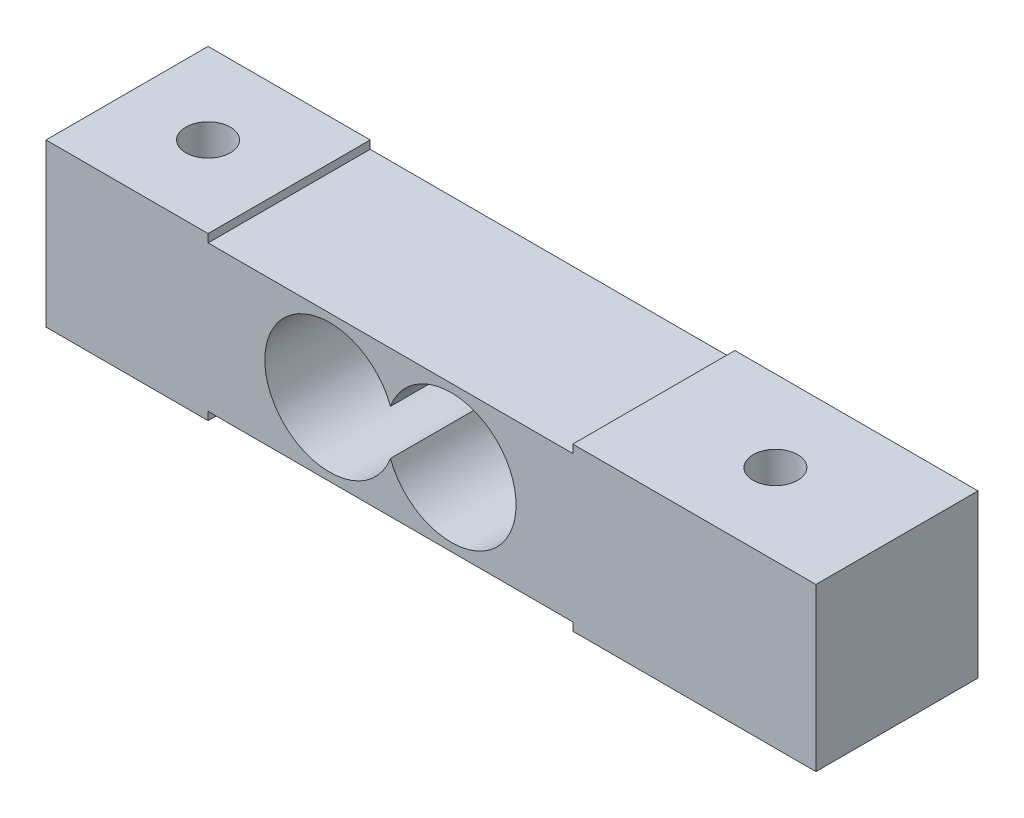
ISO-10303-21;
HEADER;
FILE_DESCRIPTION(('STEP AP214'),'2;1');
FILE_NAME('part.step','',(''),(''),'','','');
FILE_SCHEMA(('AUTOMOTIVE_DESIGN { 1 0 10303 214 1 1 1 1 }'));
ENDSEC;
DATA;
#1=APPLICATION_CONTEXT('core data for automotive mechanical design processes');
#2=APPLICATION_PROTOCOL_DEFINITION('international standard','automotive_design',2000,#1);
#3=PRODUCT_CONTEXT('',#1,'mechanical');
#4=PRODUCT('Part','Part','',(#3));
#5=PRODUCT_RELATED_PRODUCT_CATEGORY('part','',(#4));
#6=PRODUCT_DEFINITION_FORMATION('','',#4);
#7=PRODUCT_DEFINITION_CONTEXT('part definition',#1,'design');
#8=PRODUCT_DEFINITION('design','',#6,#7);
#9=PRODUCT_DEFINITION_SHAPE('','',#8);
#10=(LENGTH_UNIT() NAMED_UNIT(*) SI_UNIT(.MILLI.,.METRE.));
#11=(NAMED_UNIT(*) PLANE_ANGLE_UNIT() SI_UNIT($,.RADIAN.));
#12=(NAMED_UNIT(*) SI_UNIT($,.STERADIAN.) SOLID_ANGLE_UNIT());
#13=UNCERTAINTY_MEASURE_WITH_UNIT(LENGTH_MEASURE(1.E-05),#10,'distance_accuracy_value','');
#14=(GEOMETRIC_REPRESENTATION_CONTEXT(3) GLOBAL_UNCERTAINTY_ASSIGNED_CONTEXT((#13)) GLOBAL_UNIT_ASSIGNED_CONTEXT((#10,
#11,#12)) REPRESENTATION_CONTEXT('',''));
#15=CARTESIAN_POINT('',(0.,0.,0.));
#16=DIRECTION('',(0.,0.,1.));
#17=DIRECTION('',(1.,0.,0.));
#18=AXIS2_PLACEMENT_3D('',#15,#16,#17);
#19=CARTESIAN_POINT('',(0.,-19.,20.));
#20=DIRECTION('',(0.,0.,1.));
#21=DIRECTION('',(1.,0.,0.));
#22=AXIS2_PLACEMENT_3D('',#19,#20,#21);
#23=PLANE('',#22);
#24=DIRECTION('',(0.,-1.,0.));
#25=VECTOR('',#24,1.);
#26=CARTESIAN_POINT('',(0.,0.,20.));
#27=LINE('',#26,#25);
#28=CARTESIAN_POINT('',(0.,0.,20.));
#29=VERTEX_POINT('',#28);
#30=CARTESIAN_POINT('',(0.,-20.,20.));
#31=VERTEX_POINT('',#30);
#32=EDGE_CURVE('E179',#29,#31,#27,.T.);
#33=ORIENTED_EDGE('',*,*,#32,.T.);
#34=DIRECTION('',(1.,0.,0.));
#35=VECTOR('',#34,1.);
#36=CARTESIAN_POINT('',(0.,-20.,20.));
#37=LINE('',#36,#35);
#38=CARTESIAN_POINT('',(20.,-20.,20.));
#39=VERTEX_POINT('',#38);
#40=EDGE_CURVE('E182',#31,#39,#37,.T.);
#41=ORIENTED_EDGE('',*,*,#40,.T.);
#42=DIRECTION('',(0.,1.,0.));
#43=VECTOR('',#42,1.);
#44=CARTESIAN_POINT('',(20.,-19.,20.));
#45=LINE('',#44,#43);
#46=CARTESIAN_POINT('',(20.,-19.,20.));
#47=VERTEX_POINT('',#46);
#48=EDGE_CURVE('E184',#39,#47,#45,.T.);
#49=ORIENTED_EDGE('',*,*,#48,.T.);
#50=DIRECTION('',(1.,0.,0.));
#51=VECTOR('',#50,1.);
#52=CARTESIAN_POINT('',(20.,-19.,20.));
#53=LINE('',#52,#51);
#54=CARTESIAN_POINT('',(65.,-19.,20.));
#55=VERTEX_POINT('',#54);
#56=EDGE_CURVE('E186',#47,#55,#53,.T.);
#57=ORIENTED_EDGE('',*,*,#56,.T.);
#58=DIRECTION('',(0.,-1.,0.));
#59=VECTOR('',#58,1.);
#60=CARTESIAN_POINT('',(65.,-19.,20.));
#61=LINE('',#60,#59);
#62=CARTESIAN_POINT('',(65.,-20.,20.));
#63=VERTEX_POINT('',#62);
#64=EDGE_CURVE('E188',#55,#63,#61,.T.);
#65=ORIENTED_EDGE('',*,*,#64,.T.);
#66=DIRECTION('',(1.,0.,0.));
#67=VECTOR('',#66,1.);
#68=CARTESIAN_POINT('',(65.,-20.,20.));
#69=LINE('',#68,#67);
#70=CARTESIAN_POINT('',(95.,-20.,20.));
#71=VERTEX_POINT('',#70);
#72=EDGE_CURVE('E190',#63,#71,#69,.T.);
#73=ORIENTED_EDGE('',*,*,#72,.T.);
#74=DIRECTION('',(0.,1.,0.));
#75=VECTOR('',#74,1.);
#76=CARTESIAN_POINT('',(95.,0.,20.));
#77=LINE('',#76,#75);
#78=CARTESIAN_POINT('',(95.,0.,20.));
#79=VERTEX_POINT('',#78);
#80=EDGE_CURVE('E192',#71,#79,#77,.T.);
#81=ORIENTED_EDGE('',*,*,#80,.T.);
#82=DIRECTION('',(-1.,0.,0.));
#83=VECTOR('',#82,1.);
#84=CARTESIAN_POINT('',(65.,0.,20.));
#85=LINE('',#84,#83);
#86=CARTESIAN_POINT('',(65.,0.,20.));
#87=VERTEX_POINT('',#86);
#88=EDGE_CURVE('E194',#79,#87,#85,.T.);
#89=ORIENTED_EDGE('',*,*,#88,.T.);
#90=DIRECTION('',(0.,-1.,0.));
#91=VECTOR('',#90,1.);
#92=CARTESIAN_POINT('',(65.,0.,20.));
#93=LINE('',#92,#91);
#94=CARTESIAN_POINT('',(65.,-1.,20.));
#95=VERTEX_POINT('',#94);
#96=EDGE_CURVE('E196',#87,#95,#93,.T.);
#97=ORIENTED_EDGE('',*,*,#96,.T.);
#98=DIRECTION('',(-1.,0.,0.));
#99=VECTOR('',#98,1.);
#100=CARTESIAN_POINT('',(20.,-1.,20.));
#101=LINE('',#100,#99);
#102=CARTESIAN_POINT('',(20.,-1.,20.));
#103=VERTEX_POINT('',#102);
#104=EDGE_CURVE('E198',#95,#103,#101,.T.);
#105=ORIENTED_EDGE('',*,*,#104,.T.);
#106=DIRECTION('',(0.,1.,0.));
#107=VECTOR('',#106,1.);
#108=CARTESIAN_POINT('',(20.,0.,20.));
#109=LINE('',#108,#107);
#110=CARTESIAN_POINT('',(20.,0.,20.));
#111=VERTEX_POINT('',#110);
#112=EDGE_CURVE('E200',#103,#111,#109,.T.);
#113=ORIENTED_EDGE('',*,*,#112,.T.);
#114=DIRECTION('',(-1.,0.,0.));
#115=VECTOR('',#114,1.);
#116=CARTESIAN_POINT('',(0.,0.,20.));
#117=LINE('',#116,#115);
#118=EDGE_CURVE('E202',#111,#29,#117,.T.);
#119=ORIENTED_EDGE('',*,*,#118,.T.);
#120=EDGE_LOOP('',(#33,#41,#49,#57,#65,#73,#81,#89,#97,#105,#113,#119));
#121=FACE_BOUND('',#120,.T.);
#122=CARTESIAN_POINT('',(35.,-10.,20.));
#123=DIRECTION('',(0.,0.,1.));
#124=DIRECTION('',(1.,0.,0.));
#125=AXIS2_PLACEMENT_3D('',#122,#123,#124);
#126=CIRCLE('',#125,8.);
#127=CARTESIAN_POINT('',(42.5,-7.21611781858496,20.));
#128=VERTEX_POINT('',#127);
#129=CARTESIAN_POINT('',(42.5,-12.783882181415,20.));
#130=VERTEX_POINT('',#129);
#131=EDGE_CURVE('E152',#128,#130,#126,.T.);
#132=ORIENTED_EDGE('',*,*,#131,.F.);
#133=CARTESIAN_POINT('',(50.,-10.,20.));
#134=DIRECTION('',(0.,0.,1.));
#135=DIRECTION('',(1.,0.,0.));
#136=AXIS2_PLACEMENT_3D('',#133,#134,#135);
#137=CIRCLE('',#136,8.00000000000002);
#138=EDGE_CURVE('E136',#130,#128,#137,.T.);
#139=ORIENTED_EDGE('',*,*,#138,.F.);
#140=EDGE_LOOP('',(#132,#139));
#141=FACE_BOUND('',#140,.T.);
#142=ADVANCED_FACE('F32',(#121,#141),#23,.T.);
#143=CARTESIAN_POINT('',(0.,-19.,0.));
#144=DIRECTION('',(0.,0.,1.));
#145=DIRECTION('',(1.,0.,0.));
#146=AXIS2_PLACEMENT_3D('',#143,#144,#145);
#147=PLANE('',#146);
#148=DIRECTION('',(0.,-1.,0.));
#149=VECTOR('',#148,1.);
#150=CARTESIAN_POINT('',(0.,0.,0.));
#151=LINE('',#150,#149);
#152=CARTESIAN_POINT('',(0.,0.,0.));
#153=VERTEX_POINT('',#152);
#154=CARTESIAN_POINT('',(0.,-20.,0.));
#155=VERTEX_POINT('',#154);
#156=EDGE_CURVE('E141',#153,#155,#151,.T.);
#157=ORIENTED_EDGE('',*,*,#156,.F.);
#158=DIRECTION('',(-1.,0.,0.));
#159=VECTOR('',#158,1.);
#160=CARTESIAN_POINT('',(0.,0.,0.));
#161=LINE('',#160,#159);
#162=CARTESIAN_POINT('',(20.,0.,0.));
#163=VERTEX_POINT('',#162);
#164=EDGE_CURVE('E177',#163,#153,#161,.T.);
#165=ORIENTED_EDGE('',*,*,#164,.F.);
#166=DIRECTION('',(0.,1.,0.));
#167=VECTOR('',#166,1.);
#168=CARTESIAN_POINT('',(20.,0.,0.));
#169=LINE('',#168,#167);
#170=CARTESIAN_POINT('',(20.,-1.,0.));
#171=VERTEX_POINT('',#170);
#172=EDGE_CURVE('E175',#171,#163,#169,.T.);
#173=ORIENTED_EDGE('',*,*,#172,.F.);
#174=DIRECTION('',(-1.,0.,0.));
#175=VECTOR('',#174,1.);
#176=CARTESIAN_POINT('',(20.,-1.,0.));
#177=LINE('',#176,#175);
#178=CARTESIAN_POINT('',(65.,-1.,0.));
#179=VERTEX_POINT('',#178);
#180=EDGE_CURVE('E173',#179,#171,#177,.T.);
#181=ORIENTED_EDGE('',*,*,#180,.F.);
#182=DIRECTION('',(0.,-1.,0.));
#183=VECTOR('',#182,1.);
#184=CARTESIAN_POINT('',(65.,0.,0.));
#185=LINE('',#184,#183);
#186=CARTESIAN_POINT('',(65.,0.,0.));
#187=VERTEX_POINT('',#186);
#188=EDGE_CURVE('E171',#187,#179,#185,.T.);
#189=ORIENTED_EDGE('',*,*,#188,.F.);
#190=DIRECTION('',(-1.,0.,0.));
#191=VECTOR('',#190,1.);
#192=CARTESIAN_POINT('',(65.,0.,0.));
#193=LINE('',#192,#191);
#194=CARTESIAN_POINT('',(95.,0.,0.));
#195=VERTEX_POINT('',#194);
#196=EDGE_CURVE('E169',#195,#187,#193,.T.);
#197=ORIENTED_EDGE('',*,*,#196,.F.);
#198=DIRECTION('',(0.,1.,0.));
#199=VECTOR('',#198,1.);
#200=CARTESIAN_POINT('',(95.,0.,0.));
#201=LINE('',#200,#199);
#202=CARTESIAN_POINT('',(95.,-20.,0.));
#203=VERTEX_POINT('',#202);
#204=EDGE_CURVE('E167',#203,#195,#201,.T.);
#205=ORIENTED_EDGE('',*,*,#204,.F.);
#206=DIRECTION('',(1.,0.,0.));
#207=VECTOR('',#206,1.);
#208=CARTESIAN_POINT('',(65.,-20.,0.));
#209=LINE('',#208,#207);
#210=CARTESIAN_POINT('',(65.,-20.,0.));
#211=VERTEX_POINT('',#210);
#212=EDGE_CURVE('E165',#211,#203,#209,.T.);
#213=ORIENTED_EDGE('',*,*,#212,.F.);
#214=DIRECTION('',(0.,-1.,0.));
#215=VECTOR('',#214,1.);
#216=CARTESIAN_POINT('',(65.,-19.,0.));
#217=LINE('',#216,#215);
#218=CARTESIAN_POINT('',(65.,-19.,0.));
#219=VERTEX_POINT('',#218);
#220=EDGE_CURVE('E163',#219,#211,#217,.T.);
#221=ORIENTED_EDGE('',*,*,#220,.F.);
#222=DIRECTION('',(1.,0.,0.));
#223=VECTOR('',#222,1.);
#224=CARTESIAN_POINT('',(20.,-19.,0.));
#225=LINE('',#224,#223);
#226=CARTESIAN_POINT('',(20.,-19.,0.));
#227=VERTEX_POINT('',#226);
#228=EDGE_CURVE('E161',#227,#219,#225,.T.);
#229=ORIENTED_EDGE('',*,*,#228,.F.);
#230=DIRECTION('',(0.,1.,0.));
#231=VECTOR('',#230,1.);
#232=CARTESIAN_POINT('',(20.,-19.,0.));
#233=LINE('',#232,#231);
#234=CARTESIAN_POINT('',(20.,-20.,0.));
#235=VERTEX_POINT('',#234);
#236=EDGE_CURVE('E159',#235,#227,#233,.T.);
#237=ORIENTED_EDGE('',*,*,#236,.F.);
#238=DIRECTION('',(1.,0.,0.));
#239=VECTOR('',#238,1.);
#240=CARTESIAN_POINT('',(0.,-20.,0.));
#241=LINE('',#240,#239);
#242=EDGE_CURVE('E157',#155,#235,#241,.T.);
#243=ORIENTED_EDGE('',*,*,#242,.F.);
#244=EDGE_LOOP('',(#157,#165,#173,#181,#189,#197,#205,#213,#221,#229,#237,#243));
#245=FACE_BOUND('',#244,.T.);
#246=CARTESIAN_POINT('',(50.,-10.,0.));
#247=DIRECTION('',(0.,0.,1.));
#248=DIRECTION('',(1.,0.,0.));
#249=AXIS2_PLACEMENT_3D('',#246,#247,#248);
#250=CIRCLE('',#249,8.00000000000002);
#251=CARTESIAN_POINT('',(42.5,-12.783882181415,0.));
#252=VERTEX_POINT('',#251);
#253=CARTESIAN_POINT('',(42.5,-7.21611781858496,0.));
#254=VERTEX_POINT('',#253);
#255=EDGE_CURVE('E54',#252,#254,#250,.T.);
#256=ORIENTED_EDGE('',*,*,#255,.T.);
#257=CARTESIAN_POINT('',(35.,-10.,0.));
#258=DIRECTION('',(0.,0.,1.));
#259=DIRECTION('',(1.,0.,0.));
#260=AXIS2_PLACEMENT_3D('',#257,#258,#259);
#261=CIRCLE('',#260,8.);
#262=EDGE_CURVE('E132',#254,#252,#261,.T.);
#263=ORIENTED_EDGE('',*,*,#262,.T.);
#264=EDGE_LOOP('',(#256,#263));
#265=FACE_BOUND('',#264,.T.);
#266=ADVANCED_FACE('F143',(#245,#265),#147,.F.);
#267=CARTESIAN_POINT('',(0.,0.,20.));
#268=DIRECTION('',(1.,0.,0.));
#269=DIRECTION('',(0.,1.,0.));
#270=AXIS2_PLACEMENT_3D('',#267,#268,#269);
#271=PLANE('',#270);
#272=ORIENTED_EDGE('',*,*,#156,.T.);
#273=DIRECTION('',(0.,0.,-1.));
#274=VECTOR('',#273,1.);
#275=CARTESIAN_POINT('',(0.,-20.,20.));
#276=LINE('',#275,#274);
#277=EDGE_CURVE('E11',#31,#155,#276,.T.);
#278=ORIENTED_EDGE('',*,*,#277,.F.);
#279=ORIENTED_EDGE('',*,*,#32,.F.);
#280=DIRECTION('',(0.,0.,-1.));
#281=VECTOR('',#280,1.);
#282=CARTESIAN_POINT('',(0.,0.,20.));
#283=LINE('',#282,#281);
#284=EDGE_CURVE('E204',#29,#153,#283,.T.);
#285=ORIENTED_EDGE('',*,*,#284,.T.);
#286=EDGE_LOOP('',(#272,#278,#279,#285));
#287=FACE_BOUND('',#286,.T.);
#288=ADVANCED_FACE('F34',(#287),#271,.F.);
#289=CARTESIAN_POINT('',(0.,-20.,20.));
#290=DIRECTION('',(0.,1.,0.));
#291=DIRECTION('',(0.,0.,1.));
#292=AXIS2_PLACEMENT_3D('',#289,#290,#291);
#293=PLANE('',#292);
#294=CARTESIAN_POINT('',(10.,-20.,10.));
#295=DIRECTION('',(0.,1.,0.));
#296=DIRECTION('',(0.,0.,1.));
#297=AXIS2_PLACEMENT_3D('',#294,#295,#296);
#298=CIRCLE('',#297,2.75);
#299=CARTESIAN_POINT('',(10.,-20.,12.75));
#300=VERTEX_POINT('',#299);
#301=EDGE_CURVE('E144',#300,#300,#298,.T.);
#302=ORIENTED_EDGE('',*,*,#301,.T.);
#303=EDGE_LOOP('',(#302));
#304=FACE_BOUND('',#303,.T.);
#305=ORIENTED_EDGE('',*,*,#242,.T.);
#306=DIRECTION('',(0.,0.,-1.));
#307=VECTOR('',#306,1.);
#308=CARTESIAN_POINT('',(20.,-20.,20.));
#309=LINE('',#308,#307);
#310=EDGE_CURVE('E40',#39,#235,#309,.T.);
#311=ORIENTED_EDGE('',*,*,#310,.F.);
#312=ORIENTED_EDGE('',*,*,#40,.F.);
#313=ORIENTED_EDGE('',*,*,#277,.T.);
#314=EDGE_LOOP('',(#305,#311,#312,#313));
#315=FACE_BOUND('',#314,.T.);
#316=ADVANCED_FACE('F260',(#304,#315),#293,.F.);
#317=CARTESIAN_POINT('',(20.,-19.,20.));
#318=DIRECTION('',(-1.,0.,0.));
#319=DIRECTION('',(0.,0.,1.));
#320=AXIS2_PLACEMENT_3D('',#317,#318,#319);
#321=PLANE('',#320);
#322=ORIENTED_EDGE('',*,*,#236,.T.);
#323=DIRECTION('',(0.,0.,-1.));
#324=VECTOR('',#323,1.);
#325=CARTESIAN_POINT('',(20.,-19.,20.));
#326=LINE('',#325,#324);
#327=EDGE_CURVE('E231',#47,#227,#326,.T.);
#328=ORIENTED_EDGE('',*,*,#327,.F.);
#329=ORIENTED_EDGE('',*,*,#48,.F.);
#330=ORIENTED_EDGE('',*,*,#310,.T.);
#331=EDGE_LOOP('',(#322,#328,#329,#330));
#332=FACE_BOUND('',#331,.T.);
#333=ADVANCED_FACE('F238',(#332),#321,.F.);
#334=CARTESIAN_POINT('',(20.,-19.,20.));
#335=DIRECTION('',(0.,1.,0.));
#336=DIRECTION('',(0.,0.,1.));
#337=AXIS2_PLACEMENT_3D('',#334,#335,#336);
#338=PLANE('',#337);
#339=ORIENTED_EDGE('',*,*,#228,.T.);
#340=DIRECTION('',(0.,0.,-1.));
#341=VECTOR('',#340,1.);
#342=CARTESIAN_POINT('',(65.,-19.,20.));
#343=LINE('',#342,#341);
#344=EDGE_CURVE('E228',#55,#219,#343,.T.);
#345=ORIENTED_EDGE('',*,*,#344,.F.);
#346=ORIENTED_EDGE('',*,*,#56,.F.);
#347=ORIENTED_EDGE('',*,*,#327,.T.);
#348=EDGE_LOOP('',(#339,#345,#346,#347));
#349=FACE_BOUND('',#348,.T.);
#350=ADVANCED_FACE('F248',(#349),#338,.F.);
#351=CARTESIAN_POINT('',(65.,-19.,20.));
#352=DIRECTION('',(1.,0.,0.));
#353=DIRECTION('',(0.,0.,-1.));
#354=AXIS2_PLACEMENT_3D('',#351,#352,#353);
#355=PLANE('',#354);
#356=ORIENTED_EDGE('',*,*,#220,.T.);
#357=DIRECTION('',(0.,0.,-1.));
#358=VECTOR('',#357,1.);
#359=CARTESIAN_POINT('',(65.,-20.,20.));
#360=LINE('',#359,#358);
#361=EDGE_CURVE('E225',#63,#211,#360,.T.);
#362=ORIENTED_EDGE('',*,*,#361,.F.);
#363=ORIENTED_EDGE('',*,*,#64,.F.);
#364=ORIENTED_EDGE('',*,*,#344,.T.);
#365=EDGE_LOOP('',(#356,#362,#363,#364));
#366=FACE_BOUND('',#365,.T.);
#367=ADVANCED_FACE('F252',(#366),#355,.F.);
#368=CARTESIAN_POINT('',(65.,-20.,20.));
#369=DIRECTION('',(0.,1.,0.));
#370=DIRECTION('',(0.,0.,1.));
#371=AXIS2_PLACEMENT_3D('',#368,#369,#370);
#372=PLANE('',#371);
#373=CARTESIAN_POINT('',(80.,-20.,10.));
#374=DIRECTION('',(0.,1.,0.));
#375=DIRECTION('',(0.,0.,1.));
#376=AXIS2_PLACEMENT_3D('',#373,#374,#375);
#377=CIRCLE('',#376,2.50000000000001);
#378=CARTESIAN_POINT('',(80.,-20.,12.5));
#379=VERTEX_POINT('',#378);
#380=EDGE_CURVE('E330',#379,#379,#377,.T.);
#381=ORIENTED_EDGE('',*,*,#380,.T.);
#382=EDGE_LOOP('',(#381));
#383=FACE_BOUND('',#382,.T.);
#384=ORIENTED_EDGE('',*,*,#212,.T.);
#385=DIRECTION('',(0.,0.,-1.));
#386=VECTOR('',#385,1.);
#387=CARTESIAN_POINT('',(95.,-20.,20.));
#388=LINE('',#387,#386);
#389=EDGE_CURVE('E222',#71,#203,#388,.T.);
#390=ORIENTED_EDGE('',*,*,#389,.F.);
#391=ORIENTED_EDGE('',*,*,#72,.F.);
#392=ORIENTED_EDGE('',*,*,#361,.T.);
#393=EDGE_LOOP('',(#384,#390,#391,#392));
#394=FACE_BOUND('',#393,.T.);
#395=ADVANCED_FACE('F293',(#383,#394),#372,.F.);
#396=CARTESIAN_POINT('',(95.,0.,20.));
#397=DIRECTION('',(-1.,0.,0.));
#398=DIRECTION('',(0.,0.,1.));
#399=AXIS2_PLACEMENT_3D('',#396,#397,#398);
#400=PLANE('',#399);
#401=ORIENTED_EDGE('',*,*,#204,.T.);
#402=DIRECTION('',(0.,0.,-1.));
#403=VECTOR('',#402,1.);
#404=CARTESIAN_POINT('',(95.,0.,20.));
#405=LINE('',#404,#403);
#406=EDGE_CURVE('E219',#79,#195,#405,.T.);
#407=ORIENTED_EDGE('',*,*,#406,.F.);
#408=ORIENTED_EDGE('',*,*,#80,.F.);
#409=ORIENTED_EDGE('',*,*,#389,.T.);
#410=EDGE_LOOP('',(#401,#407,#408,#409));
#411=FACE_BOUND('',#410,.T.);
#412=ADVANCED_FACE('F291',(#411),#400,.F.);
#413=CARTESIAN_POINT('',(65.,0.,20.));
#414=DIRECTION('',(0.,-1.,0.));
#415=DIRECTION('',(0.,0.,-1.));
#416=AXIS2_PLACEMENT_3D('',#413,#414,#415);
#417=PLANE('',#416);
#418=CARTESIAN_POINT('',(80.,0.,10.));
#419=DIRECTION('',(0.,1.,0.));
#420=DIRECTION('',(0.,0.,1.));
#421=AXIS2_PLACEMENT_3D('',#418,#419,#420);
#422=CIRCLE('',#421,2.75000000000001);
#423=CARTESIAN_POINT('',(80.,0.,12.75));
#424=VERTEX_POINT('',#423);
#425=EDGE_CURVE('E327',#424,#424,#422,.T.);
#426=ORIENTED_EDGE('',*,*,#425,.F.);
#427=EDGE_LOOP('',(#426));
#428=FACE_BOUND('',#427,.T.);
#429=ORIENTED_EDGE('',*,*,#196,.T.);
#430=DIRECTION('',(0.,0.,-1.));
#431=VECTOR('',#430,1.);
#432=CARTESIAN_POINT('',(65.,0.,20.));
#433=LINE('',#432,#431);
#434=EDGE_CURVE('E216',#87,#187,#433,.T.);
#435=ORIENTED_EDGE('',*,*,#434,.F.);
#436=ORIENTED_EDGE('',*,*,#88,.F.);
#437=ORIENTED_EDGE('',*,*,#406,.T.);
#438=EDGE_LOOP('',(#429,#435,#436,#437));
#439=FACE_BOUND('',#438,.T.);
#440=ADVANCED_FACE('F287',(#428,#439),#417,.F.);
#441=CARTESIAN_POINT('',(65.,0.,20.));
#442=DIRECTION('',(1.,0.,0.));
#443=DIRECTION('',(0.,0.,-1.));
#444=AXIS2_PLACEMENT_3D('',#441,#442,#443);
#445=PLANE('',#444);
#446=ORIENTED_EDGE('',*,*,#188,.T.);
#447=DIRECTION('',(0.,0.,-1.));
#448=VECTOR('',#447,1.);
#449=CARTESIAN_POINT('',(65.,-1.,20.));
#450=LINE('',#449,#448);
#451=EDGE_CURVE('E213',#95,#179,#450,.T.);
#452=ORIENTED_EDGE('',*,*,#451,.F.);
#453=ORIENTED_EDGE('',*,*,#96,.F.);
#454=ORIENTED_EDGE('',*,*,#434,.T.);
#455=EDGE_LOOP('',(#446,#452,#453,#454));
#456=FACE_BOUND('',#455,.T.);
#457=ADVANCED_FACE('F282',(#456),#445,.F.);
#458=CARTESIAN_POINT('',(20.,-1.,20.));
#459=DIRECTION('',(0.,-1.,0.));
#460=DIRECTION('',(0.,0.,-1.));
#461=AXIS2_PLACEMENT_3D('',#458,#459,#460);
#462=PLANE('',#461);
#463=ORIENTED_EDGE('',*,*,#180,.T.);
#464=DIRECTION('',(0.,0.,-1.));
#465=VECTOR('',#464,1.);
#466=CARTESIAN_POINT('',(20.,-1.,20.));
#467=LINE('',#466,#465);
#468=EDGE_CURVE('E210',#103,#171,#467,.T.);
#469=ORIENTED_EDGE('',*,*,#468,.F.);
#470=ORIENTED_EDGE('',*,*,#104,.F.);
#471=ORIENTED_EDGE('',*,*,#451,.T.);
#472=EDGE_LOOP('',(#463,#469,#470,#471));
#473=FACE_BOUND('',#472,.T.);
#474=ADVANCED_FACE('F276',(#473),#462,.F.);
#475=CARTESIAN_POINT('',(20.,0.,20.));
#476=DIRECTION('',(-1.,0.,0.));
#477=DIRECTION('',(0.,0.,1.));
#478=AXIS2_PLACEMENT_3D('',#475,#476,#477);
#479=PLANE('',#478);
#480=ORIENTED_EDGE('',*,*,#172,.T.);
#481=DIRECTION('',(0.,0.,-1.));
#482=VECTOR('',#481,1.);
#483=CARTESIAN_POINT('',(20.,0.,20.));
#484=LINE('',#483,#482);
#485=EDGE_CURVE('E207',#111,#163,#484,.T.);
#486=ORIENTED_EDGE('',*,*,#485,.F.);
#487=ORIENTED_EDGE('',*,*,#112,.F.);
#488=ORIENTED_EDGE('',*,*,#468,.T.);
#489=EDGE_LOOP('',(#480,#486,#487,#488));
#490=FACE_BOUND('',#489,.T.);
#491=ADVANCED_FACE('F272',(#490),#479,.F.);
#492=CARTESIAN_POINT('',(0.,0.,20.));
#493=DIRECTION('',(0.,-1.,0.));
#494=DIRECTION('',(0.,0.,-1.));
#495=AXIS2_PLACEMENT_3D('',#492,#493,#494);
#496=PLANE('',#495);
#497=CARTESIAN_POINT('',(10.,0.,10.));
#498=DIRECTION('',(0.,1.,0.));
#499=DIRECTION('',(0.,0.,1.));
#500=AXIS2_PLACEMENT_3D('',#497,#498,#499);
#501=CIRCLE('',#500,2.75);
#502=CARTESIAN_POINT('',(10.,0.,12.75));
#503=VERTEX_POINT('',#502);
#504=EDGE_CURVE('E147',#503,#503,#501,.T.);
#505=ORIENTED_EDGE('',*,*,#504,.F.);
#506=EDGE_LOOP('',(#505));
#507=FACE_BOUND('',#506,.T.);
#508=ORIENTED_EDGE('',*,*,#164,.T.);
#509=ORIENTED_EDGE('',*,*,#284,.F.);
#510=ORIENTED_EDGE('',*,*,#118,.F.);
#511=ORIENTED_EDGE('',*,*,#485,.T.);
#512=EDGE_LOOP('',(#508,#509,#510,#511));
#513=FACE_BOUND('',#512,.T.);
#514=ADVANCED_FACE('F267',(#507,#513),#496,.F.);
#515=CARTESIAN_POINT('',(50.,-10.,20.));
#516=DIRECTION('',(0.,0.,-1.));
#517=DIRECTION('',(-1.,0.,0.));
#518=AXIS2_PLACEMENT_3D('',#515,#516,#517);
#519=CYLINDRICAL_SURFACE('',#518,8.00000000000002);
#520=ORIENTED_EDGE('',*,*,#255,.F.);
#521=DIRECTION('',(0.,0.,-1.));
#522=VECTOR('',#521,1.);
#523=CARTESIAN_POINT('',(42.5,-12.783882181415,20.));
#524=LINE('',#523,#522);
#525=EDGE_CURVE('E134',#130,#252,#524,.T.);
#526=ORIENTED_EDGE('',*,*,#525,.F.);
#527=ORIENTED_EDGE('',*,*,#138,.T.);
#528=DIRECTION('',(0.,0.,-1.));
#529=VECTOR('',#528,1.);
#530=CARTESIAN_POINT('',(42.5,-7.21611781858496,20.));
#531=LINE('',#530,#529);
#532=EDGE_CURVE('E47',#128,#254,#531,.T.);
#533=ORIENTED_EDGE('',*,*,#532,.T.);
#534=EDGE_LOOP('',(#520,#526,#527,#533));
#535=FACE_BOUND('',#534,.T.);
#536=ADVANCED_FACE('F138',(#535),#519,.F.);
#537=CARTESIAN_POINT('',(35.,-10.,20.));
#538=DIRECTION('',(0.,0.,-1.));
#539=DIRECTION('',(-1.,0.,0.));
#540=AXIS2_PLACEMENT_3D('',#537,#538,#539);
#541=CYLINDRICAL_SURFACE('',#540,8.);
#542=ORIENTED_EDGE('',*,*,#262,.F.);
#543=ORIENTED_EDGE('',*,*,#532,.F.);
#544=ORIENTED_EDGE('',*,*,#131,.T.);
#545=ORIENTED_EDGE('',*,*,#525,.T.);
#546=EDGE_LOOP('',(#542,#543,#544,#545));
#547=FACE_BOUND('',#546,.T.);
#548=ADVANCED_FACE('F133',(#547),#541,.F.);
#549=CARTESIAN_POINT('',(10.,-20.,10.));
#550=DIRECTION('',(0.,1.,0.));
#551=DIRECTION('',(0.,0.,1.));
#552=AXIS2_PLACEMENT_3D('',#549,#550,#551);
#553=CYLINDRICAL_SURFACE('',#552,2.75);
#554=ORIENTED_EDGE('',*,*,#301,.F.);
#555=EDGE_LOOP('',(#554));
#556=FACE_BOUND('',#555,.T.);
#557=ORIENTED_EDGE('',*,*,#504,.T.);
#558=EDGE_LOOP('',(#557));
#559=FACE_BOUND('',#558,.T.);
#560=ADVANCED_FACE('F340',(#556,#559),#553,.F.);
#561=CARTESIAN_POINT('',(80.,-5.,10.));
#562=DIRECTION('',(0.,1.,0.));
#563=DIRECTION('',(0.,0.,1.));
#564=AXIS2_PLACEMENT_3D('',#561,#562,#563);
#565=CYLINDRICAL_SURFACE('',#564,2.75000000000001);
#566=CARTESIAN_POINT('',(80.,-5.,10.));
#567=DIRECTION('',(0.,1.,0.));
#568=DIRECTION('',(0.,0.,1.));
#569=AXIS2_PLACEMENT_3D('',#566,#567,#568);
#570=CIRCLE('',#569,2.75000000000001);
#571=CARTESIAN_POINT('',(80.,-5.,12.75));
#572=VERTEX_POINT('',#571);
#573=EDGE_CURVE('E329',#572,#572,#570,.T.);
#574=ORIENTED_EDGE('',*,*,#573,.F.);
#575=EDGE_LOOP('',(#574));
#576=FACE_BOUND('',#575,.T.);
#577=ORIENTED_EDGE('',*,*,#425,.T.);
#578=EDGE_LOOP('',(#577));
#579=FACE_BOUND('',#578,.T.);
#580=ADVANCED_FACE('F342',(#576,#579),#565,.F.);
#581=CARTESIAN_POINT('',(80.,-5.,10.));
#582=DIRECTION('',(0.,1.,0.));
#583=DIRECTION('',(0.,0.,1.));
#584=AXIS2_PLACEMENT_3D('',#581,#582,#583);
#585=PLANE('',#584);
#586=CARTESIAN_POINT('',(80.,-5.,10.));
#587=DIRECTION('',(0.,1.,0.));
#588=DIRECTION('',(0.,0.,1.));
#589=AXIS2_PLACEMENT_3D('',#586,#587,#588);
#590=CIRCLE('',#589,2.50000000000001);
#591=CARTESIAN_POINT('',(80.,-5.,12.5));
#592=VERTEX_POINT('',#591);
#593=EDGE_CURVE('E334',#592,#592,#590,.T.);
#594=ORIENTED_EDGE('',*,*,#593,.F.);
#595=EDGE_LOOP('',(#594));
#596=FACE_BOUND('',#595,.T.);
#597=ORIENTED_EDGE('',*,*,#573,.T.);
#598=EDGE_LOOP('',(#597));
#599=FACE_BOUND('',#598,.T.);
#600=ADVANCED_FACE('F349',(#596,#599),#585,.T.);
#601=CARTESIAN_POINT('',(80.,-20.,10.));
#602=DIRECTION('',(0.,1.,0.));
#603=DIRECTION('',(0.,0.,1.));
#604=AXIS2_PLACEMENT_3D('',#601,#602,#603);
#605=CYLINDRICAL_SURFACE('',#604,2.50000000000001);
#606=ORIENTED_EDGE('',*,*,#380,.F.);
#607=EDGE_LOOP('',(#606));
#608=FACE_BOUND('',#607,.T.);
#609=ORIENTED_EDGE('',*,*,#593,.T.);
#610=EDGE_LOOP('',(#609));
#611=FACE_BOUND('',#610,.T.);
#612=ADVANCED_FACE('F412',(#608,#611),#605,.F.);
#613=CLOSED_SHELL('',(#142,#266,#288,#316,#333,#350,#367,#395,#412,#440,#457,#474,#491,#514,
#536,#548,#560,#580,#600,#612));
#614=MANIFOLD_SOLID_BREP('B2',#613);
#615=ADVANCED_BREP_SHAPE_REPRESENTATION('',(#18,#614),#14);
#616=SHAPE_DEFINITION_REPRESENTATION(#9,#615);
ENDSEC;
END-ISO-10303-21;
